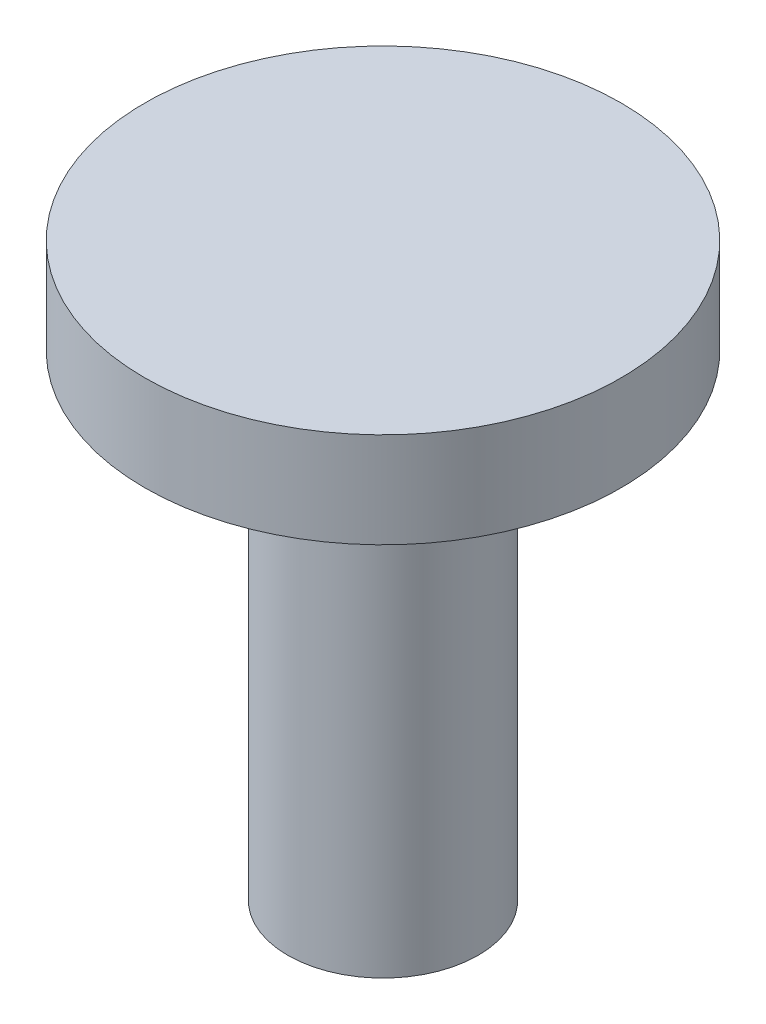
from build123d import *

# Parameters (mm, degrees)
SKETCH1_R           = 2.5
BOSS_EXTRUDE1_DEPTH = 1
SKETCH2_R           = 1
BOSS_EXTRUDE2_DEPTH = 5


with BuildPart() as part:
    # Sketch1 → Boss-Extrude1 (new body)
    with BuildSketch(Plane(origin=(0, 0, 0), x_dir=(1, 0, 0), z_dir=(0, 1, 0))):
        with Locations(Location((0, 0, 0), (0, 0, 270))):
            Circle(SKETCH1_R)
    extrude(amount=BOSS_EXTRUDE1_DEPTH)

    # Sketch2 → Boss-Extrude2 (add)
    with BuildSketch(Plane.XZ):
        with Locations(Location((0, 0, 0), (0, 0, 270))):
            Circle(SKETCH2_R)
    extrude(amount=BOSS_EXTRUDE2_DEPTH)


solid = part.part
